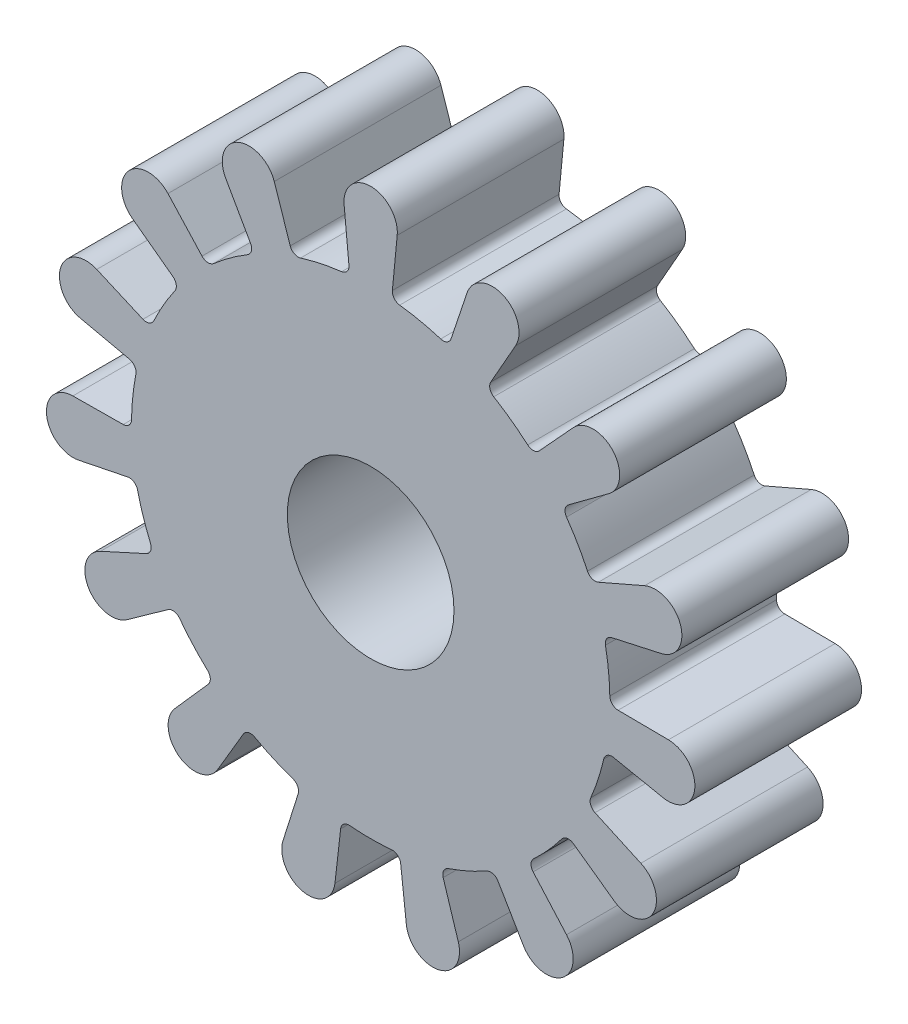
from build123d import *

# Parameters (mm, degrees)
SKETCH_1_R      = 5
EXTRUDE_1_DEPTH = 10


with BuildPart() as part:
    # Sketch 1 → Extrude 1 (new body)
    with BuildSketch(Plane.XY):
        with BuildLine():
            Line((-1.592633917, 17.796646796), (-1.302967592, 14.78834699))
            ThreePointArc((-1.302967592, 14.78834699), (-1.410820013, 14.427342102), (-1.740037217, 14.244113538))
            ThreePointArc((-1.740037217, 14.244113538), (-2.983532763, 14.036418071), (-4.203999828, 13.720382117))
            ThreePointArc((-4.203999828, 13.720382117), (-4.579280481, 13.753865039), (-4.824642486, 14.039791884))
            Line((-4.824642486, 14.039791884), (-5.783604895, 16.905828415))
            ThreePointArc((-5.783604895, 16.905828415), (-7.951701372, 17.859813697), (-8.693491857, 15.610263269))
            Line((-8.693491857, 15.610263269), (-7.205282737, 12.979862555))
            ThreePointArc((-7.205282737, 12.979862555), (-7.156976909, 12.606200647), (-7.38320602, 12.304908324))
            ThreePointArc((-7.38320602, 12.304908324), (-8.43471837, 11.609393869), (-9.421127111, 10.824271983))
            ThreePointArc((-9.421127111, 10.824271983), (-9.777581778, 10.702219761), (-10.118028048, 10.863629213))
            Line((-10.118028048, 10.863629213), (-12.159805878, 13.091838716))
            ThreePointArc((-12.159805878, 13.091838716), (-14.528481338, 13.081503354), (-14.291166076, 10.724723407))
            Line((-14.291166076, 10.724723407), (-11.861739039, 8.927041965))
            ThreePointArc((-11.861739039, 8.927041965), (-11.665627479, 8.605332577), (-11.749751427, 8.238072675))
            ThreePointArc((-11.749751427, 8.238072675), (-12.427464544, 7.175), (-13.009255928, 6.056546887))
            ThreePointArc((-13.009255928, 6.056546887), (-13.285250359, 5.800063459), (-13.661914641, 5.809046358))
            Line((-13.661914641, 5.809046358), (-16.433465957, 7.014151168))
            ThreePointArc((-16.433465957, 7.014151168), (-18.593154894, 6.04128224), (-17.41776785, 3.984781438))
            Line((-17.41776785, 3.984781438), (-14.4671929, 3.330654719))
            ThreePointArc((-14.4671929, 3.330654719), (-14.157185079, 3.116524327), (-14.08465807, 2.746799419))
            ThreePointArc((-14.08465807, 2.746799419), (-14.271389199, 1.499983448), (-14.34796621, 0.241589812))
            ThreePointArc((-14.34796621, 0.241589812), (-14.49577846, -0.104976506), (-14.843532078, -0.249973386))
            Line((-14.843532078, -0.249973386), (-17.865630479, -0.276346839))
            ThreePointArc((-17.865630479, -0.276346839), (-19.442903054, -2.043531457), (-17.532679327, -3.444165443))
            Line((-17.532679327, -3.444165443), (-14.571137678, -2.841632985))
            ThreePointArc((-14.571137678, -2.841632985), (-14.200836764, -2.911159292), (-13.984199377, -3.21942041))
            ThreePointArc((-13.984199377, -3.21942041), (-13.647661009, -4.434393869), (-13.205782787, -5.615140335))
            ThreePointArc((-13.205782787, -5.615140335), (-13.199854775, -5.99186508), (-13.45856797, -6.26577046))
            Line((-13.45856797, -6.26577046), (-16.208665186, -7.519061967))
            ThreePointArc((-16.208665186, -7.519061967), (-16.930796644, -9.775), (-14.616031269, -10.277584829))
            Line((-14.616031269, -10.277584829), (-12.155600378, -8.522576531))
            ThreePointArc((-12.155600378, -8.522576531), (-11.789034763, -8.435477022), (-11.46574557, -8.628973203))
            ThreePointArc((-11.46574557, -8.628973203), (-10.664128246, -9.602024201), (-9.780199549, -10.500961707))
            ThreePointArc((-9.780199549, -10.500961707), (-9.621556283, -10.842705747), (-9.746495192, -11.198158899))
            Line((-9.746495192, -11.198158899), (-11.749074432, -13.461662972))
            ThreePointArc((-11.749074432, -13.461662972), (-11.491201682, -15.81628224), (-9.172138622, -15.33391643))
            Line((-9.172138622, -15.33391643), (-7.638249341, -12.729889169))
            ThreePointArc((-7.638249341, -12.729889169), (-7.338801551, -12.501224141), (-6.96476019, -12.546498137))
            ThreePointArc((-6.96476019, -12.546498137), (-5.836670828, -13.109377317), (-4.663530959, -13.571071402))
            ThreePointArc((-4.663530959, -13.571071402), (-4.379603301, -13.818744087), (-4.349164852, -14.194283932))
            Line((-4.349164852, -14.194283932), (-5.257961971, -17.076620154))
            ThreePointArc((-5.257961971, -17.076620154), (-4.064673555, -19.122785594), (-2.142299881, -17.738874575))
            Line((-2.142299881, -17.738874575), (-1.800175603, -14.736088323))
            ThreePointArc((-1.800175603, -14.736088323), (-1.61962288, -14.405396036), (-1.259504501, -14.294619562))
            ThreePointArc((-1.259504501, -14.294619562), (0, -14.35), (1.259504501, -14.294619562))
            ThreePointArc((1.259504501, -14.294619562), (1.61962288, -14.405396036), (1.800175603, -14.736088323))
            Line((1.800175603, -14.736088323), (2.142299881, -17.738874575))
            ThreePointArc((2.142299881, -17.738874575), (4.064673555, -19.122785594), (5.257961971, -17.076620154))
            Line((5.257961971, -17.076620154), (4.349164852, -14.194283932))
            ThreePointArc((4.349164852, -14.194283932), (4.379603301, -13.818744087), (4.663530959, -13.571071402))
            ThreePointArc((4.663530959, -13.571071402), (5.836670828, -13.109377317), (6.96476019, -12.546498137))
            ThreePointArc((6.96476019, -12.546498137), (7.338801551, -12.501224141), (7.638249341, -12.729889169))
            Line((7.638249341, -12.729889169), (9.172138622, -15.33391643))
            ThreePointArc((9.172138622, -15.33391643), (11.491201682, -15.81628224), (11.749074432, -13.461662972))
            Line((11.749074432, -13.461662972), (9.746495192, -11.198158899))
            ThreePointArc((9.746495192, -11.198158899), (9.621556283, -10.842705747), (9.780199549, -10.500961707))
            ThreePointArc((9.780199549, -10.500961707), (10.664128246, -9.602024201), (11.46574557, -8.628973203))
            ThreePointArc((11.46574557, -8.628973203), (11.789034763, -8.435477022), (12.155600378, -8.522576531))
            Line((12.155600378, -8.522576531), (14.616031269, -10.277584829))
            ThreePointArc((14.616031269, -10.277584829), (16.930796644, -9.775), (16.208665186, -7.519061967))
            Line((16.208665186, -7.519061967), (13.45856797, -6.26577046))
            ThreePointArc((13.45856797, -6.26577046), (13.199854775, -5.99186508), (13.205782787, -5.615140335))
            ThreePointArc((13.205782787, -5.615140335), (13.647661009, -4.434393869), (13.984199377, -3.21942041))
            ThreePointArc((13.984199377, -3.21942041), (14.200836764, -2.911159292), (14.571137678, -2.841632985))
            Line((14.571137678, -2.841632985), (17.532679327, -3.444165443))
            ThreePointArc((17.532679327, -3.444165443), (19.442903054, -2.043531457), (17.865630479, -0.276346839))
            Line((17.865630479, -0.276346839), (14.843532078, -0.249973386))
            ThreePointArc((14.843532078, -0.249973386), (14.49577846, -0.104976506), (14.34796621, 0.241589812))
            ThreePointArc((14.34796621, 0.241589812), (14.271389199, 1.499983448), (14.08465807, 2.746799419))
            ThreePointArc((14.08465807, 2.746799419), (14.157185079, 3.116524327), (14.4671929, 3.330654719))
            Line((14.4671929, 3.330654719), (17.41776785, 3.984781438))
            ThreePointArc((17.41776785, 3.984781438), (18.593154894, 6.04128224), (16.433465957, 7.014151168))
            Line((16.433465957, 7.014151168), (13.661914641, 5.809046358))
            ThreePointArc((13.661914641, 5.809046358), (13.285250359, 5.800063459), (13.009255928, 6.056546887))
            ThreePointArc((13.009255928, 6.056546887), (12.427464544, 7.175), (11.749751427, 8.238072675))
            ThreePointArc((11.749751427, 8.238072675), (11.665627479, 8.605332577), (11.861739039, 8.927041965))
            Line((11.861739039, 8.927041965), (14.291166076, 10.724723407))
            ThreePointArc((14.291166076, 10.724723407), (14.528481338, 13.081503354), (12.159805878, 13.091838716))
            Line((12.159805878, 13.091838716), (10.118028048, 10.863629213))
            ThreePointArc((10.118028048, 10.863629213), (9.777581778, 10.702219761), (9.421127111, 10.824271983))
            ThreePointArc((9.421127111, 10.824271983), (8.43471837, 11.609393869), (7.38320602, 12.304908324))
            ThreePointArc((7.38320602, 12.304908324), (7.156976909, 12.606200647), (7.205282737, 12.979862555))
            Line((7.205282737, 12.979862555), (8.693491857, 15.610263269))
            ThreePointArc((8.693491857, 15.610263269), (7.951701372, 17.859813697), (5.783604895, 16.905828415))
            Line((5.783604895, 16.905828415), (4.824642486, 14.039791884))
            ThreePointArc((4.824642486, 14.039791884), (4.579280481, 13.753865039), (4.203999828, 13.720382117))
            ThreePointArc((4.203999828, 13.720382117), (2.983532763, 14.036418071), (1.740037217, 14.244113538))
            ThreePointArc((1.740037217, 14.244113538), (1.410820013, 14.427342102), (1.302967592, 14.78834699))
            Line((1.302967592, 14.78834699), (1.592633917, 17.796646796))
            ThreePointArc((1.592633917, 17.796646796), (0, 19.55), (-1.592633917, 17.796646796))
        make_face()
        Circle(SKETCH_1_R, mode=Mode.SUBTRACT)
    extrude(amount=EXTRUDE_1_DEPTH)


solid = part.part
